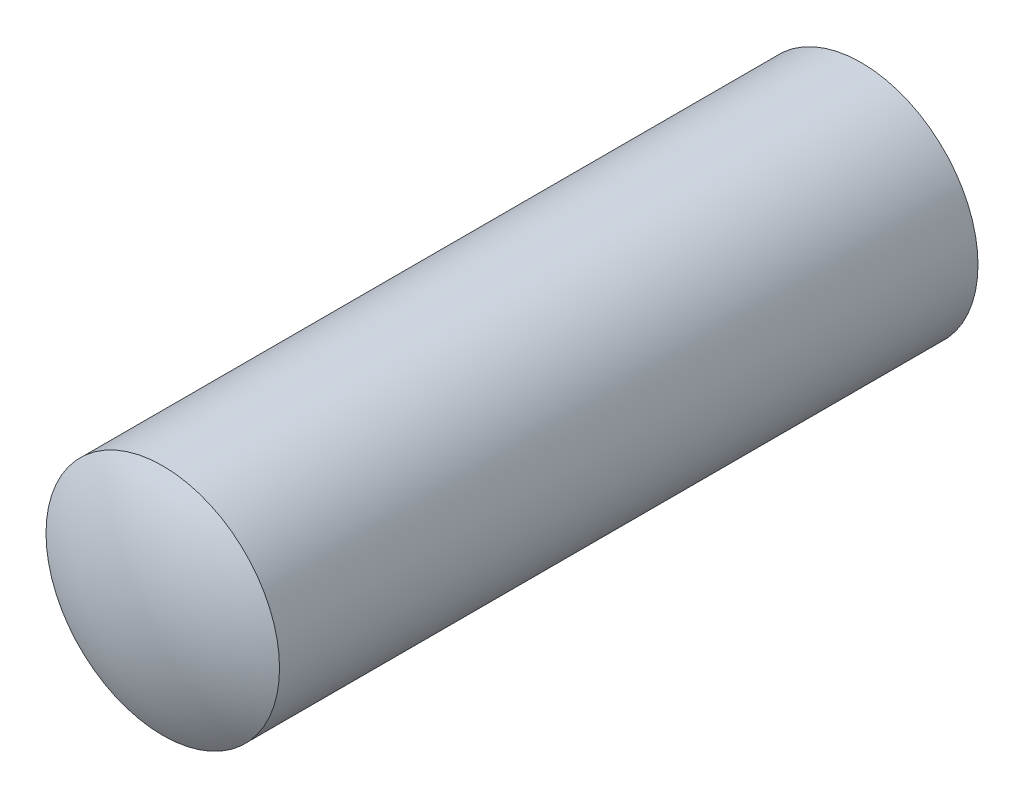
ISO-10303-21;
HEADER;
FILE_DESCRIPTION(('STEP AP214'),'2;1');
FILE_NAME('part.step','',(''),(''),'','','');
FILE_SCHEMA(('AUTOMOTIVE_DESIGN { 1 0 10303 214 1 1 1 1 }'));
ENDSEC;
DATA;
#1=APPLICATION_CONTEXT('core data for automotive mechanical design processes');
#2=APPLICATION_PROTOCOL_DEFINITION('international standard','automotive_design',2000,#1);
#3=PRODUCT_CONTEXT('',#1,'mechanical');
#4=PRODUCT('Part','Part','',(#3));
#5=PRODUCT_RELATED_PRODUCT_CATEGORY('part','',(#4));
#6=PRODUCT_DEFINITION_FORMATION('','',#4);
#7=PRODUCT_DEFINITION_CONTEXT('part definition',#1,'design');
#8=PRODUCT_DEFINITION('design','',#6,#7);
#9=PRODUCT_DEFINITION_SHAPE('','',#8);
#10=(LENGTH_UNIT() NAMED_UNIT(*) SI_UNIT(.MILLI.,.METRE.));
#11=(NAMED_UNIT(*) PLANE_ANGLE_UNIT() SI_UNIT($,.RADIAN.));
#12=(NAMED_UNIT(*) SI_UNIT($,.STERADIAN.) SOLID_ANGLE_UNIT());
#13=UNCERTAINTY_MEASURE_WITH_UNIT(LENGTH_MEASURE(1.E-05),#10,'distance_accuracy_value','');
#14=(GEOMETRIC_REPRESENTATION_CONTEXT(3) GLOBAL_UNCERTAINTY_ASSIGNED_CONTEXT((#13)) GLOBAL_UNIT_ASSIGNED_CONTEXT((#10,
#11,#12)) REPRESENTATION_CONTEXT('',''));
#15=CARTESIAN_POINT('',(0.,0.,0.));
#16=DIRECTION('',(0.,0.,1.));
#17=DIRECTION('',(1.,0.,0.));
#18=AXIS2_PLACEMENT_3D('',#15,#16,#17);
#19=CARTESIAN_POINT('',(0.,0.,17.));
#20=DIRECTION('',(0.,0.,-1.));
#21=DIRECTION('',(1.,0.,0.));
#22=AXIS2_PLACEMENT_3D('',#19,#20,#21);
#23=SPHERICAL_SURFACE('',#22,8.);
#24=CARTESIAN_POINT('',(0.,0.,23.9282032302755));
#25=DIRECTION('',(0.,0.,-1.));
#26=DIRECTION('',(-1.,0.,0.));
#27=AXIS2_PLACEMENT_3D('',#24,#25,#26);
#28=CIRCLE('',#27,4.);
#29=CARTESIAN_POINT('',(-4.,0.,23.9282032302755));
#30=VERTEX_POINT('',#29);
#31=EDGE_CURVE('E9',#30,#30,#28,.T.);
#32=ORIENTED_EDGE('',*,*,#31,.F.);
#33=EDGE_LOOP('',(#32));
#34=FACE_BOUND('',#33,.T.);
#35=ADVANCED_FACE('F14',(#34),#23,.T.);
#36=CARTESIAN_POINT('',(0.,0.,0.));
#37=DIRECTION('',(0.,0.,-1.));
#38=DIRECTION('',(-1.,0.,0.));
#39=AXIS2_PLACEMENT_3D('',#36,#37,#38);
#40=CYLINDRICAL_SURFACE('',#39,4.);
#41=CARTESIAN_POINT('',(0.,0.,0.));
#42=DIRECTION('',(0.,0.,-1.));
#43=DIRECTION('',(-1.,0.,0.));
#44=AXIS2_PLACEMENT_3D('',#41,#42,#43);
#45=CIRCLE('',#44,4.);
#46=CARTESIAN_POINT('',(-4.,0.,0.));
#47=VERTEX_POINT('',#46);
#48=EDGE_CURVE('E20',#47,#47,#45,.T.);
#49=ORIENTED_EDGE('',*,*,#48,.F.);
#50=EDGE_LOOP('',(#49));
#51=FACE_BOUND('',#50,.T.);
#52=ORIENTED_EDGE('',*,*,#31,.T.);
#53=EDGE_LOOP('',(#52));
#54=FACE_BOUND('',#53,.T.);
#55=ADVANCED_FACE('F28',(#51,#54),#40,.T.);
#56=CARTESIAN_POINT('',(0.,0.,0.));
#57=DIRECTION('',(0.,0.,1.));
#58=DIRECTION('',(1.,0.,0.));
#59=AXIS2_PLACEMENT_3D('',#56,#57,#58);
#60=PLANE('',#59);
#61=ORIENTED_EDGE('',*,*,#48,.T.);
#62=EDGE_LOOP('',(#61));
#63=FACE_BOUND('',#62,.T.);
#64=ADVANCED_FACE('F26',(#63),#60,.F.);
#65=CLOSED_SHELL('',(#35,#55,#64));
#66=MANIFOLD_SOLID_BREP('B1',#65);
#67=ADVANCED_BREP_SHAPE_REPRESENTATION('',(#18,#66),#14);
#68=SHAPE_DEFINITION_REPRESENTATION(#9,#67);
ENDSEC;
END-ISO-10303-21;
